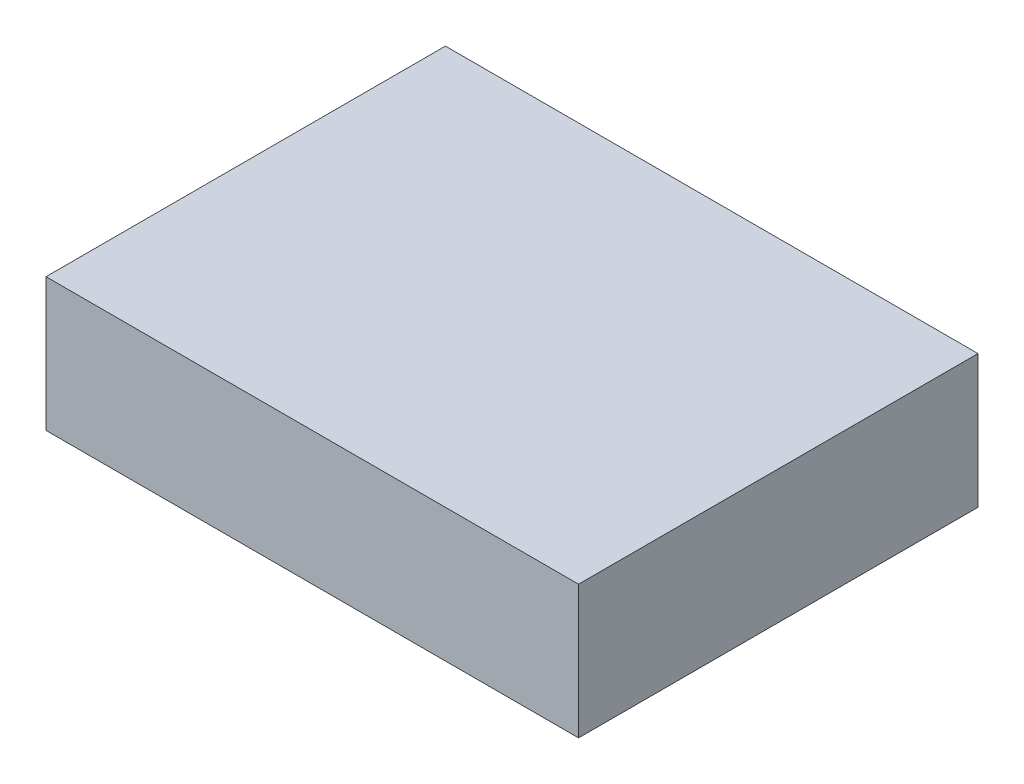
from build123d import *

# Parameters (mm, degrees)
SKIZZE1_W               = 40
SKIZZE1_H               = 10
LINEAR_AUSTRAGEN1_DEPTH = 15


with BuildPart() as part:
    # Skizze1 → Linear austragen1 (new, symmetric)
    with BuildSketch(Plane.XY):
        Rectangle(SKIZZE1_W, SKIZZE1_H)
    extrude(amount=LINEAR_AUSTRAGEN1_DEPTH, both=True)


solid = part.part
